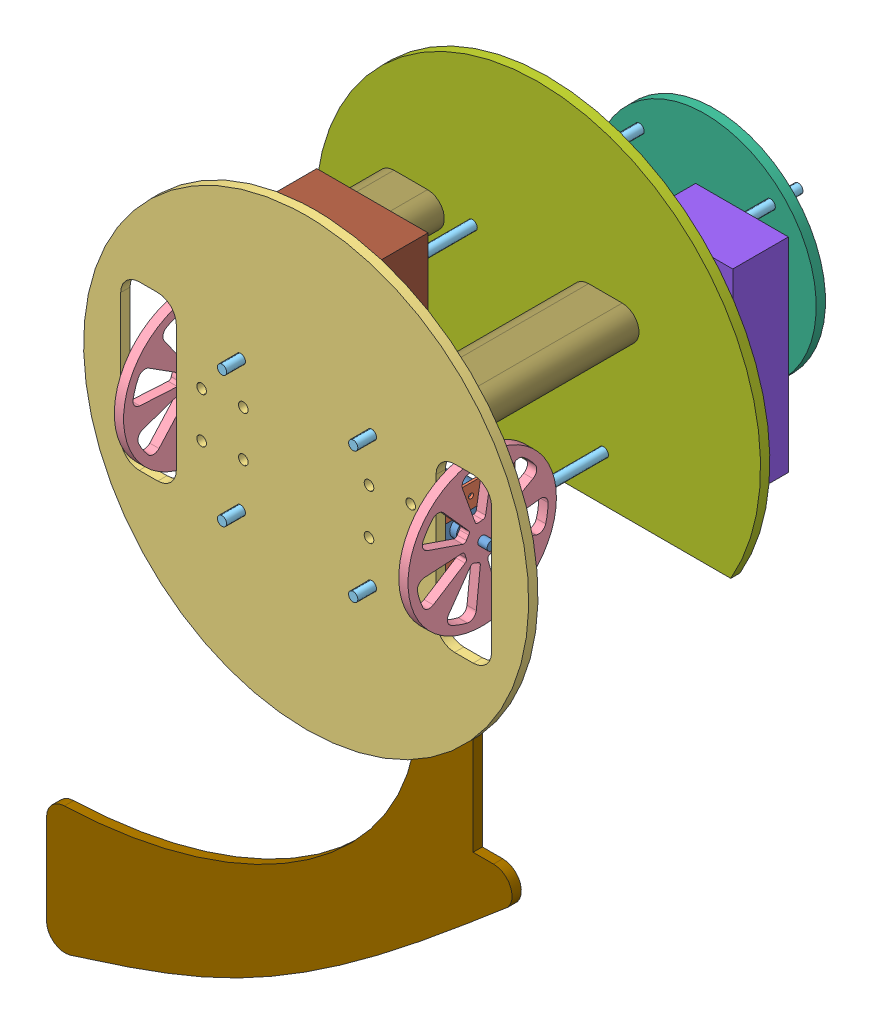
SolidWorks assembly roller wheel + hub + motor + base_v3.SLDASM, configuration Default (file format 3800). Lengths in mm.
Overall size (336.55 526.26 338.46).
24 component instances, 13 part files, 43 mates.
Components (placement in the parent):
- dc motor - jameco_161382-1: dc motor - jameco_161382.SLDPRT [Default] at (34.8504 -67.121 -143.7638) x (0 0 1) z (-1 0 0) size (37 37 63.9)
- L channel _bracket style-1: L channel _bracket style.SLDPRT [Default] at (84.0629 -90.5585 -104.6263) size (50.8 15.88 50.8)
- L channel _bracket style-2: L channel _bracket style.SLDPRT [Default] at (84.0629 -59.5586 -104.6263) size (50.8 15.88 50.8)
- Base plate_v2-1: Base plate_v2.SLDPRT [Default] at (119.1568 -67.1211 -98.2763) x (1 0 0) z (0 1 0) size (304.8 6.35 304.8)
- roller wheel + hub + motor-1: roller wheel + hub + motor.SLDASM [Default] at (180.3506 -58.14 -114.3441) x (-1 0 0) z (0 0 1) size (71.81 132.7 132.7)
  - dc motor - jameco_161382-1: dc motor - jameco_161382.SLDPRT [Default] at (-23.1125 8.981 -29.4197) x (0 0 1) z (-1 0 0) size (37 37 63.9)
  - L channel _bracket style-1: L channel _bracket style.SLDPRT [Default] at (26.1 -14.4565 9.7178) size (50.8 15.88 50.8)
  - L channel _bracket style-2: L channel _bracket style.SLDPRT [Default] at (26.1 16.5435 9.7178) size (50.8 15.88 50.8)
  - acrylic wheel 4in diameter-1: acrylic wheel 4in diameter.SLDPRT [Default] at (-33.0125 8.981 -3.9197) x (0 0.381849 -0.924225) z (0 0.924225 0.381849) size (101.6 6.35 101.6)
- all-thread rod-1: all-thread rod.SLDPRT [Default] at (74.2555 -22.2198 -85.5763) x (1 0 0) z (0 1 0) size (6.35 304.8 6.35)
- all-thread rod-2: all-thread rod.SLDPRT [Default] at (164.058 -22.2198 -85.5763) x (1 0 0) z (0 1 0) size (6.35 304.8 6.35)
- all-thread rod-3: all-thread rod.SLDPRT [Default] at (74.2555 -112.0224 -85.5763) x (1 0 0) z (0 1 0) size (6.35 304.8 6.35)
- all-thread rod-4: all-thread rod.SLDPRT [Default] at (164.058 -112.0224 -85.5763) x (1 0 0) z (0 1 0) size (6.35 304.8 6.35)
- top platform for beacon-1: top platform for beacon.SLDPRT [Default] at (119.1568 -67.1211 -377.6763) size (152.4 152.4 6.35)
- second level deck-1: second level deck.SLDPRT [Default] at (119.1568 -67.1211 -257.0263) x (1 0 0) z (0 1 0) size (304.8 6.35 228.6)
- door lock motor-1: door lock motor.SLDPRT [Default] at (182.6568 -105.2211 -301.4763) x (0 -1 0) z (-1 0 0) size (139.7 38.1 63.5)
- ski v3-1: ski v3.SLDPRT [Default] at (239.764 -176.3441 -104.6263) x (1 0 0) z (0 1 0) size (318.78 6.35 290.04)
- acrylic wheel 4in diameter-1: acrylic wheel 4in diameter.SLDPRT [Default] at (24.9504 -67.121 -118.2638) x (0 0.381849 -0.924225) z (0 0.924225 0.381849) size (101.6 6.35 101.6)
- Breadboard-1: Breadboard.SLDPRT [Default] at (158.6137 -208.1549 -117.3263) x (0 1 0) z (0 0 1) size (177.8 76.2 12.7)
- c32board-1: c32board.SLDPRT [Default] at (81.9914 -29.333 -142.7263) size (76.2 101.6 38.1)
- battery-1: battery.SLDPRT [Default] at (42.7292 -5.8697 -234.8013) size (46.04 23.02 130.18)
- hBridge-1: hBridge.SLDPRT [Default] at (26.5665 -175.5378 -130.0263) size (50.8 50.8 25.4)
- hBridge-2: hBridge.SLDPRT [Default] at (89.4869 -85.3798 -288.7763) size (50.8 50.8 25.4)
- battery-2: battery.SLDPRT [Default] at (176.0265 -6.4845 -234.8013) size (46.04 23.02 130.18)
Mates (geometry in assembly coordinates):
- Concentric7: concentric anti-aligned: cylinder of dc motor - jameco_161382-1; cylinder of L channel _bracket style-1
- Coincident3: coincident anti-aligned: plane of dc motor - jameco_161382-1 through (34.8504 -67.121 -125.2638) normal (-1 0 0); plane of L channel _bracket style-1 through (34.8504 -74.6835 -155.4263) normal (1 0 0)
- Concentric8: concentric anti-aligned: cylinder of dc motor - jameco_161382-1; cylinder of L channel _bracket style-2
- Coincident4: coincident anti-aligned: plane of dc motor - jameco_161382-1 through (34.8504 -67.121 -125.2638) normal (-1 0 0); plane of L channel _bracket style-2 through (34.8504 -43.6836 -155.4263) normal (1 0 0)
- Parallel1: parallel aligned: plane of L channel _bracket style-1 through (84.0629 -74.6835 -104.6263) normal (0 0 1); plane of L channel _bracket style-2 through (84.0629 -43.6836 -104.6263) normal (0 0 1)
- Coincident5: coincident anti-aligned: plane of L channel _bracket style-2 through (84.0629 -43.6836 -104.6263) normal (0 0 1); plane of Base plate_v2-1 through (-216.2647 -67.1211 -104.6263) normal (0 0 -1)
- Concentric9: concentric anti-aligned: cylinder of L channel _bracket style-2; cylinder of Base plate_v2-1
- Concentric10: concentric anti-aligned: cylinder of L channel _bracket style-1; cylinder of Base plate_v2-1
- Concentric11: concentric anti-aligned: cylinder of L channel _bracket style-2; cylinder of Base plate_v2-1
- Concentric12: concentric anti-aligned: cylinder of L channel _bracket style-1; cylinder of Base plate_v2-1
- Coincident6: coincident anti-aligned: plane of Base plate_v2-1 through (-216.2647 -67.1211 -104.6263) normal (0 0 -1); plane of roller wheel + hub + motor-1/L channel _bracket style-2 through (154.2506 -90.5585 -104.6263) normal (0 0 1)
- Concentric14: concentric anti-aligned: cylinder of Base plate_v2-1; cylinder of roller wheel + hub + motor-1/L channel _bracket style-2
- Concentric15: concentric anti-aligned: cylinder of Base plate_v2-1; cylinder of roller wheel + hub + motor-1/L channel _bracket style-1
- Concentric16: concentric anti-aligned: cylinder of Base plate_v2-1; cylinder of all-thread rod-1
- Distance4: distance = 12.7 mm aligned: plane of all-thread rod-1 through (74.2555 -22.2198 -85.5763) normal (0 0 1); plane of Base plate_v2-1 through (-216.2647 -67.1211 -98.2763) normal (0 0 1)
- Concentric17: concentric anti-aligned: cylinder of Base plate_v2-1; cylinder of all-thread rod-2
- Distance5: distance = 12.7 mm aligned: plane of all-thread rod-2 through (164.058 -22.2198 -85.5763) normal (0 0 1); plane of Base plate_v2-1 through (-216.2647 -67.1211 -98.2763) normal (0 0 1)
- Concentric18: concentric anti-aligned: cylinder of Base plate_v2-1; cylinder of all-thread rod-3
- Distance6: distance = 12.7 mm aligned: plane of all-thread rod-3 through (74.2555 -112.0224 -85.5763) normal (0 0 1); plane of Base plate_v2-1 through (-216.2647 -67.1211 -98.2763) normal (0 0 1)
- Concentric19: concentric anti-aligned: cylinder of Base plate_v2-1; cylinder of all-thread rod-4
- Distance7: distance = 12.7 mm aligned: plane of all-thread rod-4 through (164.058 -112.0224 -85.5763) normal (0 0 1); plane of Base plate_v2-1 through (-216.2647 -67.1211 -98.2763) normal (0 0 1)
- Concentric20: concentric aligned: cylinder of all-thread rod-1; cylinder of top platform for beacon-1
- Concentric21: concentric aligned: cylinder of all-thread rod-2; circle of top platform for beacon-1
- Distance8: distance = 12.7 mm aligned: plane of top platform for beacon-1 through (119.1568 -67.1211 -377.6763) normal (0 0 -1); plane of all-thread rod-2 through (164.058 -22.2198 -390.3763) normal (0 0 -1)
- Concentric22: concentric anti-aligned: cylinder of all-thread rod-3; cylinder of second level deck-1
- Concentric23: concentric anti-aligned: cylinder of all-thread rod-1; cylinder of second level deck-1
- Distance9: distance = 152.4 mm anti-aligned: plane of second level deck-1 through (119.1568 -67.1211 -257.0263) normal (0 0 1); plane of Base plate_v2-1 through (-216.2647 -67.1211 -104.6263) normal (0 0 -1)
- Coincident14: coincident anti-aligned: plane of second level deck-1 through (119.1568 -67.1211 -263.3763) normal (0 0 -1); plane of door lock motor-1 through (246.1568 -105.2211 -263.3763) normal (0 0 1)
- Distance11: distance = 38.1 mm aligned: plane of door lock motor-1 through (182.6568 -105.2211 -263.3763) normal (0 -1 0); plane of second level deck-1 through (-12.8255 -143.3211 -263.3763) normal (0 -1 0)
- Distance12: distance = 25.4 mm aligned: plane of door lock motor-1 through (246.1568 -105.2211 -263.3763) normal (1 0 0); cylinder of second level deck-1
- Coincident15: coincident anti-aligned: plane of Base plate_v2-1 through (-216.2647 -67.1211 -104.6263) normal (0 0 -1); plane of ski v3-1 through (241.0846 -254.2365 -104.6263) normal (0 0 1)
- Distance15: distance = 7.62 mm anti-aligned: plane of ski v3-1 through (189.0096 -150.9411 -110.9763) normal (0 1 0); plane of second level deck-1 through (-12.8255 -143.3211 -263.3763) normal (0 -1 0)
- Distance17: distance = 19.05 mm anti-aligned: plane of ski v3-1 through (227.1068 -176.3441 -110.9763) normal (1 0 0); plane of Base plate_v2-1 through (246.1568 -67.1211 -104.6263) normal (-1 0 0)
- Concentric24: concentric aligned: cylinder of dc motor - jameco_161382-1; cylinder of acrylic wheel 4in diameter-1
- Distance18: distance = 12.7 mm anti-aligned: plane of dc motor - jameco_161382-1 through (12.2504 -67.121 -118.2638) normal (-1 0 0); plane of acrylic wheel 4in diameter-1 through (24.9504 -67.121 -118.2638) normal (1 0 0)
- Coincident17: coincident anti-aligned: plane of Base plate_v2-1 through (-216.2647 -67.1211 -104.6263) normal (0 0 -1); plane of battery-1 through (42.7292 -5.8697 -104.6263) normal (0 0 1)
- Coincident18: coincident anti-aligned: plane of battery-2 through (176.0265 -6.4845 -104.6263) normal (0 0 1); plane of Base plate_v2-1 through (-216.2647 -67.1211 -104.6263) normal (0 0 -1)
- Coincident19: coincident anti-aligned: plane of Base plate_v2-1 through (-216.2647 -67.1211 -104.6263) normal (0 0 -1); plane of c32board-1 through (81.9914 72.267 -104.6263) normal (0 0 1)
- Coincident20: coincident anti-aligned: plane of Base plate_v2-1 through (-216.2647 -67.1211 -104.6263) normal (0 0 -1); plane of hBridge-1 through (26.5665 -124.7378 -104.6263) normal (0 0 1)
- Coincident22: coincident anti-aligned: plane of Base plate_v2-1 through (-216.2647 -67.1211 -104.6263) normal (0 0 -1); plane of Breadboard-1 through (82.4137 -208.1549 -104.6263) normal (0 0 1)
- Concentric25: concentric anti-aligned: cylinder of dc motor - jameco_161382-1; cylinder of roller wheel + hub + motor-1/dc motor - jameco_161382-1
- Coincident23: coincident anti-aligned: plane of Base plate_v2-1 through (246.1568 -67.1211 -104.6263) normal (-1 0 0); plane of ? through (246.1568 -60.8601 -118.2638) normal (1 0 0)
- Coincident25: coincident anti-aligned: plane of second level deck-1 through (119.1568 -67.1211 -263.3763) normal (0 0 -1); plane of hBridge-2 through (89.4869 -34.5798 -263.3763) normal (0 0 1)
